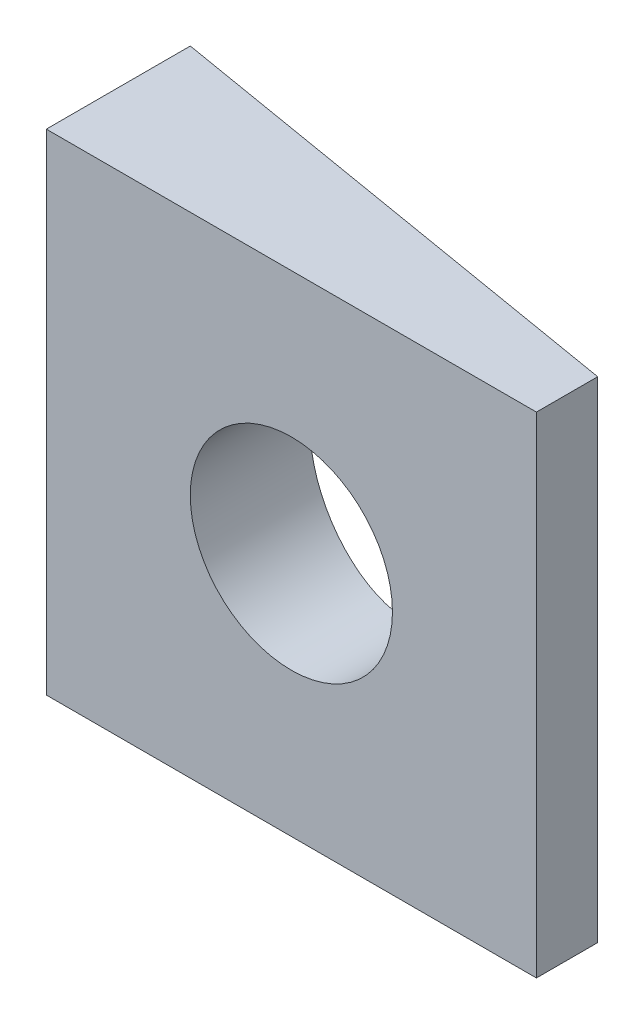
from build123d import *

# Parameters (mm, degrees)
SKETCH1_W          = 16
SKETCH1_H          = 16
SKETCH1_R          = 3.3
BASE_EXTRUDE_DEPTH = 4.7
CUT_EXTRUDE1_DEPTH = 19.473210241


with BuildPart() as part:
    # Sketch1 → Base-Extrude (new body)
    with BuildSketch(Plane.XY):
        Rectangle(SKETCH1_W, SKETCH1_H)
        Circle(SKETCH1_R, mode=Mode.SUBTRACT)
    extrude(amount=-BASE_EXTRUDE_DEPTH)

    # Sketch2 → Cut-Extrude1 (cut, through all)
    with BuildSketch(Plane(origin=(0.193434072, 8, -4.257597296), x_dir=(-1, 0, 0), z_dir=(0, 1, 0))):
        Polygon((-7.806565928, -0.442402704), (8.193434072, -0.442402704), (-7.806565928, 2.257597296), align=None)
    extrude(amount=-CUT_EXTRUDE1_DEPTH, mode=Mode.SUBTRACT)


solid = part.part
